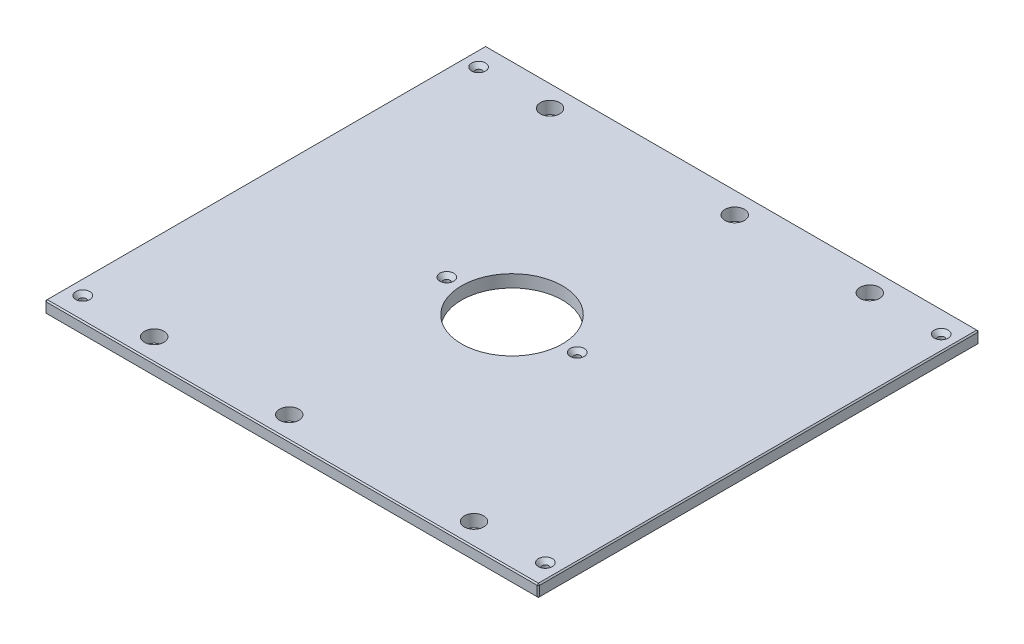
from build123d import *

# Parameters (mm, degrees)
SKETCH1_W                                        = 504.825
SKETCH1_H                                        = 450.85
BOSS_EXTRUDE1_DEPTH                              = 12.7
SKETCH13_R                                       = 51.562
CUT_EXTRUDE6_DEPTH                               = 339.658811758
F_25_32_0_78125_DIAMETER_HOLE1_D                 = 19.84375
CHAMFER2_SIZE                                    = 1.27
CSK_FOR_1_4_FLAT_HEAD_MACHINE_SCREW1_D           = 6.7564
CSK_FOR_1_4_FLAT_HEAD_MACHINE_SCREW1_CSINK_D     = 14.2748
CSK_FOR_1_4_FLAT_HEAD_MACHINE_SCREW1_CSINK_ANGLE = 82


with BuildPart() as part:
    # Sketch1 → Boss-Extrude1 (new body)
    with BuildSketch(Plane(origin=(0, 0, 0), x_dir=(1, 0, 0), z_dir=(0, 1, 0))):
        Rectangle(SKETCH1_W, SKETCH1_H)
    extrude(amount=BOSS_EXTRUDE1_DEPTH)

    # Sketch13 → Cut-Extrude6 (cut, through all)
    with BuildSketch(Plane(origin=(0, 12.7, 0), x_dir=(1, 0, 0), z_dir=(0, 1, 0))):
        with Locations(Location((0, 0, 0), (0, 0, 270))):
            Circle(SKETCH13_R)
    extrude(amount=-CUT_EXTRUDE6_DEPTH, mode=Mode.SUBTRACT)

    # 25_32 _0.78125_ Diameter Hole1 (through all)
    with Locations(Plane(origin=(0, 12.7, 0), x_dir=(1, 0, 0), z_dir=(0, 1, 0))):
        with Locations((163.5125, 202.40498), (-163.5125, 202.40498), (163.5125, -202.40498), (-163.5125, -202.40498), (25.4, 202.40498), (-25.4, -202.40498)):
            Hole(F_25_32_0_78125_DIAMETER_HOLE1_D / 2)

    # Chamfer2
    chamfer2_edges = [part.edges().sort_by_distance(p)[0] for p in [
        (252.4125, 12.7, 0),
        (0, 12.7, -225.425),
        (-252.4125, 12.7, 0),
        (0, 0, -225.425),
        (252.4125, 0, 0),
        (0, 0, 225.425),
        (-252.4125, 0, 0),
        (0, 12.7, 225.425),
        (-252.4125, 6.35, -225.425),
        (252.4125, 6.35, -225.425),
        (252.4125, 6.35, 225.425),
        (-252.4125, 6.35, 225.425),
    ]]
    chamfer(chamfer2_edges, length=CHAMFER2_SIZE)

    # CSK for 1_4 Flat Head Machine Screw1 (through all)
    with Locations(Plane(origin=(0, 12.7, 0), x_dir=(1, 0, 0), z_dir=(0, 1, 0))):
        with Locations((236.5375, 202.40498), (236.5375, -202.40498), (-236.5375, -202.40498), (-66.675, 0), (66.675, 0), (-236.5375, 202.40498), (-163.5125, 202.40498), (-163.5125, -202.40498)):
            CounterSinkHole(CSK_FOR_1_4_FLAT_HEAD_MACHINE_SCREW1_D / 2, CSK_FOR_1_4_FLAT_HEAD_MACHINE_SCREW1_CSINK_D / 2, counter_sink_angle=CSK_FOR_1_4_FLAT_HEAD_MACHINE_SCREW1_CSINK_ANGLE)


solid = part.part
